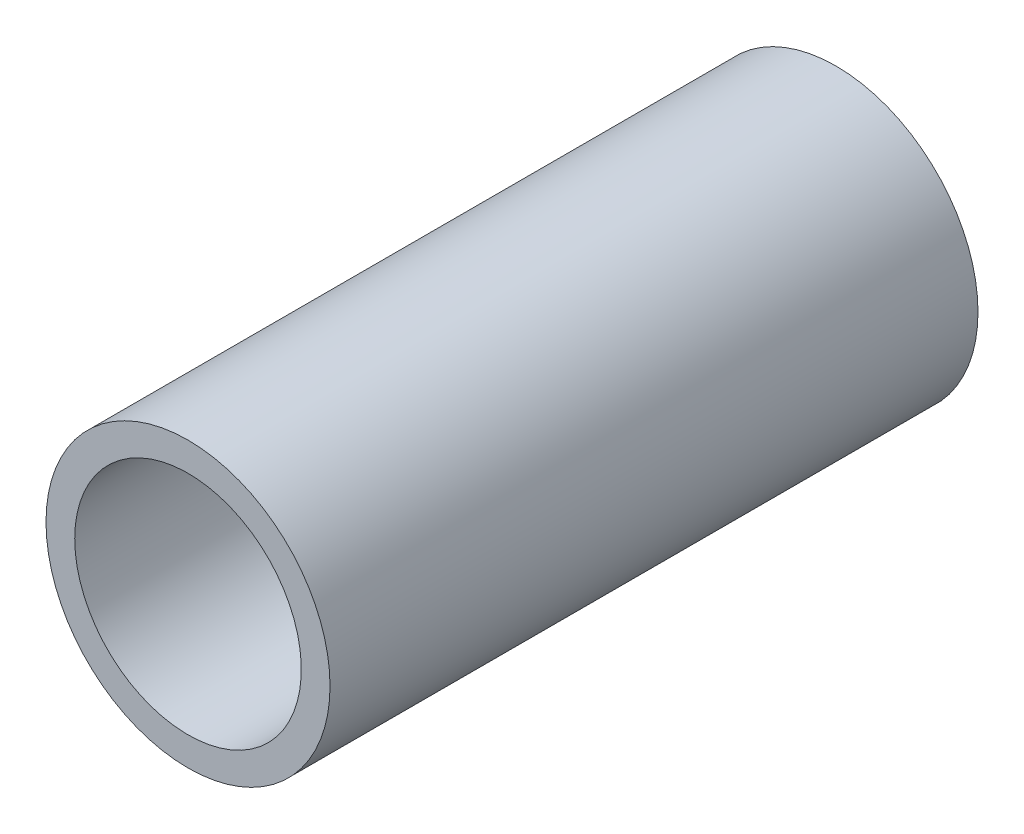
ISO-10303-21;
HEADER;
FILE_DESCRIPTION(('STEP AP214'),'2;1');
FILE_NAME('part.step','',(''),(''),'','','');
FILE_SCHEMA(('AUTOMOTIVE_DESIGN { 1 0 10303 214 1 1 1 1 }'));
ENDSEC;
DATA;
#1=APPLICATION_CONTEXT('core data for automotive mechanical design processes');
#2=APPLICATION_PROTOCOL_DEFINITION('international standard','automotive_design',2000,#1);
#3=PRODUCT_CONTEXT('',#1,'mechanical');
#4=PRODUCT('Part','Part','',(#3));
#5=PRODUCT_RELATED_PRODUCT_CATEGORY('part','',(#4));
#6=PRODUCT_DEFINITION_FORMATION('','',#4);
#7=PRODUCT_DEFINITION_CONTEXT('part definition',#1,'design');
#8=PRODUCT_DEFINITION('design','',#6,#7);
#9=PRODUCT_DEFINITION_SHAPE('','',#8);
#10=(LENGTH_UNIT() NAMED_UNIT(*) SI_UNIT(.MILLI.,.METRE.));
#11=(NAMED_UNIT(*) PLANE_ANGLE_UNIT() SI_UNIT($,.RADIAN.));
#12=(NAMED_UNIT(*) SI_UNIT($,.STERADIAN.) SOLID_ANGLE_UNIT());
#13=UNCERTAINTY_MEASURE_WITH_UNIT(LENGTH_MEASURE(1.E-05),#10,'distance_accuracy_value','');
#14=(GEOMETRIC_REPRESENTATION_CONTEXT(3) GLOBAL_UNCERTAINTY_ASSIGNED_CONTEXT((#13)) GLOBAL_UNIT_ASSIGNED_CONTEXT((#10,
#11,#12)) REPRESENTATION_CONTEXT('',''));
#15=CARTESIAN_POINT('',(0.,0.,0.));
#16=DIRECTION('',(0.,0.,1.));
#17=DIRECTION('',(1.,0.,0.));
#18=AXIS2_PLACEMENT_3D('',#15,#16,#17);
#19=CARTESIAN_POINT('',(0.,0.,76.2));
#20=DIRECTION('',(0.,0.,1.));
#21=DIRECTION('',(1.,0.,0.));
#22=AXIS2_PLACEMENT_3D('',#19,#20,#21);
#23=PLANE('',#22);
#24=CARTESIAN_POINT('',(0.,0.,76.2));
#25=DIRECTION('',(0.,0.,1.));
#26=DIRECTION('',(1.,0.,0.));
#27=AXIS2_PLACEMENT_3D('',#24,#25,#26);
#28=CIRCLE('',#27,16.7005);
#29=CARTESIAN_POINT('',(-16.7005,0.,76.2));
#30=VERTEX_POINT('',#29);
#31=EDGE_CURVE('E10',#30,#30,#28,.T.);
#32=ORIENTED_EDGE('',*,*,#31,.T.);
#33=EDGE_LOOP('',(#32));
#34=FACE_BOUND('',#33,.T.);
#35=CARTESIAN_POINT('',(0.,0.,76.2));
#36=DIRECTION('',(0.,0.,1.));
#37=DIRECTION('',(1.,0.,0.));
#38=AXIS2_PLACEMENT_3D('',#35,#36,#37);
#39=CIRCLE('',#38,13.3223);
#40=CARTESIAN_POINT('',(-13.3223,0.,76.2));
#41=VERTEX_POINT('',#40);
#42=EDGE_CURVE('E41',#41,#41,#39,.T.);
#43=ORIENTED_EDGE('',*,*,#42,.F.);
#44=EDGE_LOOP('',(#43));
#45=FACE_BOUND('',#44,.T.);
#46=ADVANCED_FACE('F30',(#34,#45),#23,.T.);
#47=CARTESIAN_POINT('',(0.,0.,0.));
#48=DIRECTION('',(0.,0.,1.));
#49=DIRECTION('',(1.,0.,0.));
#50=AXIS2_PLACEMENT_3D('',#47,#48,#49);
#51=PLANE('',#50);
#52=CARTESIAN_POINT('',(0.,0.,0.));
#53=DIRECTION('',(0.,0.,1.));
#54=DIRECTION('',(1.,0.,0.));
#55=AXIS2_PLACEMENT_3D('',#52,#53,#54);
#56=CIRCLE('',#55,16.7005);
#57=CARTESIAN_POINT('',(-16.7005,0.,0.));
#58=VERTEX_POINT('',#57);
#59=EDGE_CURVE('E34',#58,#58,#56,.T.);
#60=ORIENTED_EDGE('',*,*,#59,.F.);
#61=EDGE_LOOP('',(#60));
#62=FACE_BOUND('',#61,.T.);
#63=CARTESIAN_POINT('',(0.,0.,0.));
#64=DIRECTION('',(0.,0.,1.));
#65=DIRECTION('',(1.,0.,0.));
#66=AXIS2_PLACEMENT_3D('',#63,#64,#65);
#67=CIRCLE('',#66,13.3223);
#68=CARTESIAN_POINT('',(-13.3223,0.,0.));
#69=VERTEX_POINT('',#68);
#70=EDGE_CURVE('E43',#69,#69,#67,.T.);
#71=ORIENTED_EDGE('',*,*,#70,.T.);
#72=EDGE_LOOP('',(#71));
#73=FACE_BOUND('',#72,.T.);
#74=ADVANCED_FACE('F53',(#62,#73),#51,.F.);
#75=CARTESIAN_POINT('',(0.,0.,76.2));
#76=DIRECTION('',(0.,0.,-1.));
#77=DIRECTION('',(-1.,0.,0.));
#78=AXIS2_PLACEMENT_3D('',#75,#76,#77);
#79=CYLINDRICAL_SURFACE('',#78,16.7005);
#80=CARTESIAN_POINT('',(-16.7005,0.,76.2));
#81=CARTESIAN_POINT('',(-16.7005,0.,75.40625));
#82=CARTESIAN_POINT('',(-16.7005,0.,74.6125));
#83=CARTESIAN_POINT('',(-16.7005,0.,73.025));
#84=CARTESIAN_POINT('',(-16.7005,0.,72.23125));
#85=CARTESIAN_POINT('',(-16.7005,0.,70.64375));
#86=CARTESIAN_POINT('',(-16.7005,0.,69.85));
#87=CARTESIAN_POINT('',(-16.7005,0.,68.2625));
#88=CARTESIAN_POINT('',(-16.7005,0.,67.46875));
#89=CARTESIAN_POINT('',(-16.7005,0.,65.88125));
#90=CARTESIAN_POINT('',(-16.7005,0.,65.0875));
#91=CARTESIAN_POINT('',(-16.7005,0.,63.5));
#92=CARTESIAN_POINT('',(-16.7005,0.,62.70625));
#93=CARTESIAN_POINT('',(-16.7005,0.,61.11875));
#94=CARTESIAN_POINT('',(-16.7005,0.,60.325));
#95=CARTESIAN_POINT('',(-16.7005,0.,58.7375));
#96=CARTESIAN_POINT('',(-16.7005,0.,57.94375));
#97=CARTESIAN_POINT('',(-16.7005,0.,56.35625));
#98=CARTESIAN_POINT('',(-16.7005,0.,55.5625));
#99=CARTESIAN_POINT('',(-16.7005,0.,53.975));
#100=CARTESIAN_POINT('',(-16.7005,0.,53.18125));
#101=CARTESIAN_POINT('',(-16.7005,0.,51.59375));
#102=CARTESIAN_POINT('',(-16.7005,0.,50.8));
#103=CARTESIAN_POINT('',(-16.7005,0.,49.2125));
#104=CARTESIAN_POINT('',(-16.7005,0.,48.41875));
#105=CARTESIAN_POINT('',(-16.7005,0.,46.83125));
#106=CARTESIAN_POINT('',(-16.7005,0.,46.0375));
#107=CARTESIAN_POINT('',(-16.7005,0.,44.45));
#108=CARTESIAN_POINT('',(-16.7005,0.,43.65625));
#109=CARTESIAN_POINT('',(-16.7005,0.,42.06875));
#110=CARTESIAN_POINT('',(-16.7005,0.,41.275));
#111=CARTESIAN_POINT('',(-16.7005,0.,39.6875));
#112=CARTESIAN_POINT('',(-16.7005,0.,38.89375));
#113=CARTESIAN_POINT('',(-16.7005,0.,37.30625));
#114=CARTESIAN_POINT('',(-16.7005,0.,36.5125));
#115=CARTESIAN_POINT('',(-16.7005,0.,34.925));
#116=CARTESIAN_POINT('',(-16.7005,0.,34.13125));
#117=CARTESIAN_POINT('',(-16.7005,0.,32.54375));
#118=CARTESIAN_POINT('',(-16.7005,0.,31.75));
#119=CARTESIAN_POINT('',(-16.7005,0.,30.1625));
#120=CARTESIAN_POINT('',(-16.7005,0.,29.36875));
#121=CARTESIAN_POINT('',(-16.7005,0.,27.78125));
#122=CARTESIAN_POINT('',(-16.7005,0.,26.9875));
#123=CARTESIAN_POINT('',(-16.7005,0.,25.4));
#124=CARTESIAN_POINT('',(-16.7005,0.,24.60625));
#125=CARTESIAN_POINT('',(-16.7005,0.,23.01875));
#126=CARTESIAN_POINT('',(-16.7005,0.,22.225));
#127=CARTESIAN_POINT('',(-16.7005,0.,20.6375));
#128=CARTESIAN_POINT('',(-16.7005,0.,19.84375));
#129=CARTESIAN_POINT('',(-16.7005,0.,18.25625));
#130=CARTESIAN_POINT('',(-16.7005,0.,17.4625));
#131=CARTESIAN_POINT('',(-16.7005,0.,15.875));
#132=CARTESIAN_POINT('',(-16.7005,0.,15.08125));
#133=CARTESIAN_POINT('',(-16.7005,0.,13.49375));
#134=CARTESIAN_POINT('',(-16.7005,0.,12.7));
#135=CARTESIAN_POINT('',(-16.7005,0.,11.1125));
#136=CARTESIAN_POINT('',(-16.7005,0.,10.31875));
#137=CARTESIAN_POINT('',(-16.7005,0.,8.73125));
#138=CARTESIAN_POINT('',(-16.7005,0.,7.93750000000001));
#139=CARTESIAN_POINT('',(-16.7005,0.,6.35));
#140=CARTESIAN_POINT('',(-16.7005,0.,5.55625));
#141=CARTESIAN_POINT('',(-16.7005,0.,3.96875));
#142=CARTESIAN_POINT('',(-16.7005,0.,3.175));
#143=CARTESIAN_POINT('',(-16.7005,0.,1.5875));
#144=CARTESIAN_POINT('',(-16.7005,0.,0.793750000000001));
#145=CARTESIAN_POINT('',(-16.7005,0.,0.));
#146=B_SPLINE_CURVE_WITH_KNOTS('',3,(#80,#81,#82,#83,#84,#85,#86,#87,#88,#89,#90,#91,#92,#93,
#94,#95,#96,#97,#98,#99,#100,#101,#102,#103,#104,#105,#106,#107,#108,#109,#110,#111,#112,#113,
#114,#115,#116,#117,#118,#119,#120,#121,#122,#123,#124,#125,#126,#127,#128,#129,#130,#131,#132,
#133,#134,#135,#136,#137,#138,#139,#140,#141,#142,#143,#144,#145),.UNSPECIFIED.,.F.,.F.,(4,2,2,
2,2,2,2,2,2,2,2,2,2,2,2,2,2,2,2,2,2,2,2,2,2,2,2,2,2,2,2,2,4),(0.,2.38125,4.7625,7.14375,
9.52500000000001,11.90625,14.2875,16.66875,19.05,21.43125,23.8125,26.19375,28.575,30.95625,
33.3375,35.71875,38.1,40.48125,42.8625,45.24375,47.625,50.00625,52.3875,54.76875,57.15,59.53125,
61.9125,64.29375,66.675,69.05625,71.4375,73.81875,76.2),.UNSPECIFIED.);
#147=EDGE_CURVE('BSEAM32',#30,#58,#146,.T.);
#148=ORIENTED_EDGE('',*,*,#31,.F.);
#149=ORIENTED_EDGE('',*,*,#59,.T.);
#150=ORIENTED_EDGE('',*,*,#147,.T.);
#151=ORIENTED_EDGE('',*,*,#147,.F.);
#152=EDGE_LOOP('',(#148,#150,#149,#151));
#153=FACE_BOUND('',#152,.T.);
#154=ADVANCED_FACE('F32',(#153),#79,.T.);
#155=CARTESIAN_POINT('',(0.,0.,76.2));
#156=DIRECTION('',(0.,0.,-1.));
#157=DIRECTION('',(-1.,0.,0.));
#158=AXIS2_PLACEMENT_3D('',#155,#156,#157);
#159=CYLINDRICAL_SURFACE('',#158,13.3223);
#160=CARTESIAN_POINT('',(-13.3223,0.,76.2));
#161=CARTESIAN_POINT('',(-13.3223,0.,75.40625));
#162=CARTESIAN_POINT('',(-13.3223,0.,74.6125));
#163=CARTESIAN_POINT('',(-13.3223,0.,73.025));
#164=CARTESIAN_POINT('',(-13.3223,0.,72.23125));
#165=CARTESIAN_POINT('',(-13.3223,0.,70.64375));
#166=CARTESIAN_POINT('',(-13.3223,0.,69.85));
#167=CARTESIAN_POINT('',(-13.3223,0.,68.2625));
#168=CARTESIAN_POINT('',(-13.3223,0.,67.46875));
#169=CARTESIAN_POINT('',(-13.3223,0.,65.88125));
#170=CARTESIAN_POINT('',(-13.3223,0.,65.0875));
#171=CARTESIAN_POINT('',(-13.3223,0.,63.5));
#172=CARTESIAN_POINT('',(-13.3223,0.,62.70625));
#173=CARTESIAN_POINT('',(-13.3223,0.,61.11875));
#174=CARTESIAN_POINT('',(-13.3223,0.,60.325));
#175=CARTESIAN_POINT('',(-13.3223,0.,58.7375));
#176=CARTESIAN_POINT('',(-13.3223,0.,57.94375));
#177=CARTESIAN_POINT('',(-13.3223,0.,56.35625));
#178=CARTESIAN_POINT('',(-13.3223,0.,55.5625));
#179=CARTESIAN_POINT('',(-13.3223,0.,53.975));
#180=CARTESIAN_POINT('',(-13.3223,0.,53.18125));
#181=CARTESIAN_POINT('',(-13.3223,0.,51.59375));
#182=CARTESIAN_POINT('',(-13.3223,0.,50.8));
#183=CARTESIAN_POINT('',(-13.3223,0.,49.2125));
#184=CARTESIAN_POINT('',(-13.3223,0.,48.41875));
#185=CARTESIAN_POINT('',(-13.3223,0.,46.83125));
#186=CARTESIAN_POINT('',(-13.3223,0.,46.0375));
#187=CARTESIAN_POINT('',(-13.3223,0.,44.45));
#188=CARTESIAN_POINT('',(-13.3223,0.,43.65625));
#189=CARTESIAN_POINT('',(-13.3223,0.,42.06875));
#190=CARTESIAN_POINT('',(-13.3223,0.,41.275));
#191=CARTESIAN_POINT('',(-13.3223,0.,39.6875));
#192=CARTESIAN_POINT('',(-13.3223,0.,38.89375));
#193=CARTESIAN_POINT('',(-13.3223,0.,37.30625));
#194=CARTESIAN_POINT('',(-13.3223,0.,36.5125));
#195=CARTESIAN_POINT('',(-13.3223,0.,34.925));
#196=CARTESIAN_POINT('',(-13.3223,0.,34.13125));
#197=CARTESIAN_POINT('',(-13.3223,0.,32.54375));
#198=CARTESIAN_POINT('',(-13.3223,0.,31.75));
#199=CARTESIAN_POINT('',(-13.3223,0.,30.1625));
#200=CARTESIAN_POINT('',(-13.3223,0.,29.36875));
#201=CARTESIAN_POINT('',(-13.3223,0.,27.78125));
#202=CARTESIAN_POINT('',(-13.3223,0.,26.9875));
#203=CARTESIAN_POINT('',(-13.3223,0.,25.4));
#204=CARTESIAN_POINT('',(-13.3223,0.,24.60625));
#205=CARTESIAN_POINT('',(-13.3223,0.,23.01875));
#206=CARTESIAN_POINT('',(-13.3223,0.,22.225));
#207=CARTESIAN_POINT('',(-13.3223,0.,20.6375));
#208=CARTESIAN_POINT('',(-13.3223,0.,19.84375));
#209=CARTESIAN_POINT('',(-13.3223,0.,18.25625));
#210=CARTESIAN_POINT('',(-13.3223,0.,17.4625));
#211=CARTESIAN_POINT('',(-13.3223,0.,15.875));
#212=CARTESIAN_POINT('',(-13.3223,0.,15.08125));
#213=CARTESIAN_POINT('',(-13.3223,0.,13.49375));
#214=CARTESIAN_POINT('',(-13.3223,0.,12.7));
#215=CARTESIAN_POINT('',(-13.3223,0.,11.1125));
#216=CARTESIAN_POINT('',(-13.3223,0.,10.31875));
#217=CARTESIAN_POINT('',(-13.3223,0.,8.73125));
#218=CARTESIAN_POINT('',(-13.3223,0.,7.93750000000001));
#219=CARTESIAN_POINT('',(-13.3223,0.,6.35));
#220=CARTESIAN_POINT('',(-13.3223,0.,5.55625));
#221=CARTESIAN_POINT('',(-13.3223,0.,3.96875));
#222=CARTESIAN_POINT('',(-13.3223,0.,3.175));
#223=CARTESIAN_POINT('',(-13.3223,0.,1.5875));
#224=CARTESIAN_POINT('',(-13.3223,0.,0.793750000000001));
#225=CARTESIAN_POINT('',(-13.3223,0.,0.));
#226=B_SPLINE_CURVE_WITH_KNOTS('',3,(#160,#161,#162,#163,#164,#165,#166,#167,#168,#169,#170,
#171,#172,#173,#174,#175,#176,#177,#178,#179,#180,#181,#182,#183,#184,#185,#186,#187,#188,#189,
#190,#191,#192,#193,#194,#195,#196,#197,#198,#199,#200,#201,#202,#203,#204,#205,#206,#207,#208,
#209,#210,#211,#212,#213,#214,#215,#216,#217,#218,#219,#220,#221,#222,#223,#224,#225),
.UNSPECIFIED.,.F.,.F.,(4,2,2,2,2,2,2,2,2,2,2,2,2,2,2,2,2,2,2,2,2,2,2,2,2,2,2,2,2,2,2,2,4),(0.,
2.38125,4.7625,7.14375,9.52500000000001,11.90625,14.2875,16.66875,19.05,21.43125,23.8125,
26.19375,28.575,30.95625,33.3375,35.71875,38.1,40.48125,42.8625,45.24375,47.625,50.00625,
52.3875,54.76875,57.15,59.53125,61.9125,64.29375,66.675,69.05625,71.4375,73.81875,76.2),.UNSPECIFIED.);
#227=EDGE_CURVE('BSEAM49',#41,#69,#226,.T.);
#228=ORIENTED_EDGE('',*,*,#42,.T.);
#229=ORIENTED_EDGE('',*,*,#70,.F.);
#230=ORIENTED_EDGE('',*,*,#227,.T.);
#231=ORIENTED_EDGE('',*,*,#227,.F.);
#232=EDGE_LOOP('',(#228,#230,#229,#231));
#233=FACE_BOUND('',#232,.T.);
#234=ADVANCED_FACE('F49',(#233),#159,.F.);
#235=CLOSED_SHELL('',(#46,#74,#154,#234));
#236=MANIFOLD_SOLID_BREP('B2',#235);
#237=ADVANCED_BREP_SHAPE_REPRESENTATION('',(#18,#236),#14);
#238=SHAPE_DEFINITION_REPRESENTATION(#9,#237);
ENDSEC;
END-ISO-10303-21;
